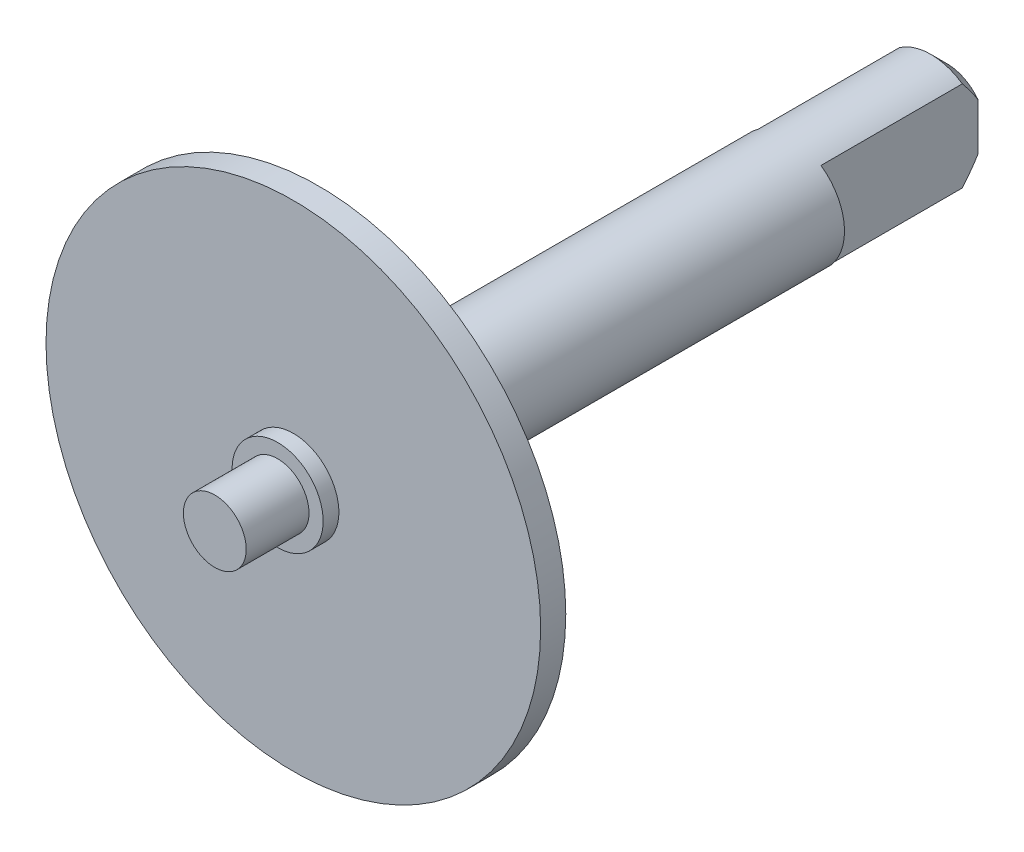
from build123d import *

# Parameters (mm, degrees)
Z_KLAD_PROTA_EN_DEPTH         = 2.5
Z_KLAD_PROTA_EN_DEPTH_BACK    = 15
SKICA1_R                      = 1.75
ODEBR_N_PROTA_EN_1_DEPTH      = 20.134393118
ODEBR_N_PROTA_EN_1_DEPTH_BACK = 20.134393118
ZKOSEN_2_SIZE                 = 0.5


with BuildPart() as part:
    # Skica1 → Z_klad-Prota_en (new, two sides: drawn at the far end of the back side and taken through both)
    with BuildSketch(Plane.XY.offset(-Z_KLAD_PROTA_EN_DEPTH_BACK)):
        with Locations((10, 0)):
            Circle(SKICA1_R)
    extrude(amount=Z_KLAD_PROTA_EN_DEPTH + Z_KLAD_PROTA_EN_DEPTH_BACK)

    # Skica2 → Odebr_n_-Prota_en_1 (cut, two sides: drawn at the far end of the back side and taken through both)
    with BuildSketch(Plane(origin=(0, 0, 0), x_dir=(1, 0, 0), z_dir=(0, 1, 0)).offset(-ODEBR_N_PROTA_EN_1_DEPTH_BACK)):
        Polygon((47.711509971, 10), (11.75, 10), (11, 10), (11, 15), (9, 15), (9, 10), (8.25, 10), (-27.711509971, 10), (-27.711509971, 81.923019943), (47.711509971, 81.923019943), align=None)
    extrude(amount=ODEBR_N_PROTA_EN_1_DEPTH + ODEBR_N_PROTA_EN_1_DEPTH_BACK, mode=Mode.SUBTRACT)

    # Zkosen_2
    zkosen_2_edges = [part.edges().sort_by_distance(p)[0] for p in [
        (10, 1.75, -15),
        (10, -1.75, -15),
    ]]
    chamfer(zkosen_2_edges, length=ZKOSEN_2_SIZE)

    # Skica4 → P_id_n_-Rota_n_1 (revolve)
    with BuildSketch(Plane(origin=(0, 0, 0), x_dir=(1, 0, 0), z_dir=(0, 1, 0)), mode=Mode.PRIVATE) as p_id_n_rota_n_1_sk:
        Polygon((10, -2.5), (12.05, -2.5), (12.05, -5), (17.875, -5), (17.875, -5.8), (11.45, -5.8), (11.45, -6.3), (11, -6.3), (11, -8.3), (10, -8.3), align=None)
    revolve(p_id_n_rota_n_1_sk.sketch.rotate(Axis((10, 0, 2.5), (0, 0, 1)), 180), axis=Axis((10, 0, 2.5), (0, 0, 1)))


solid = part.part
